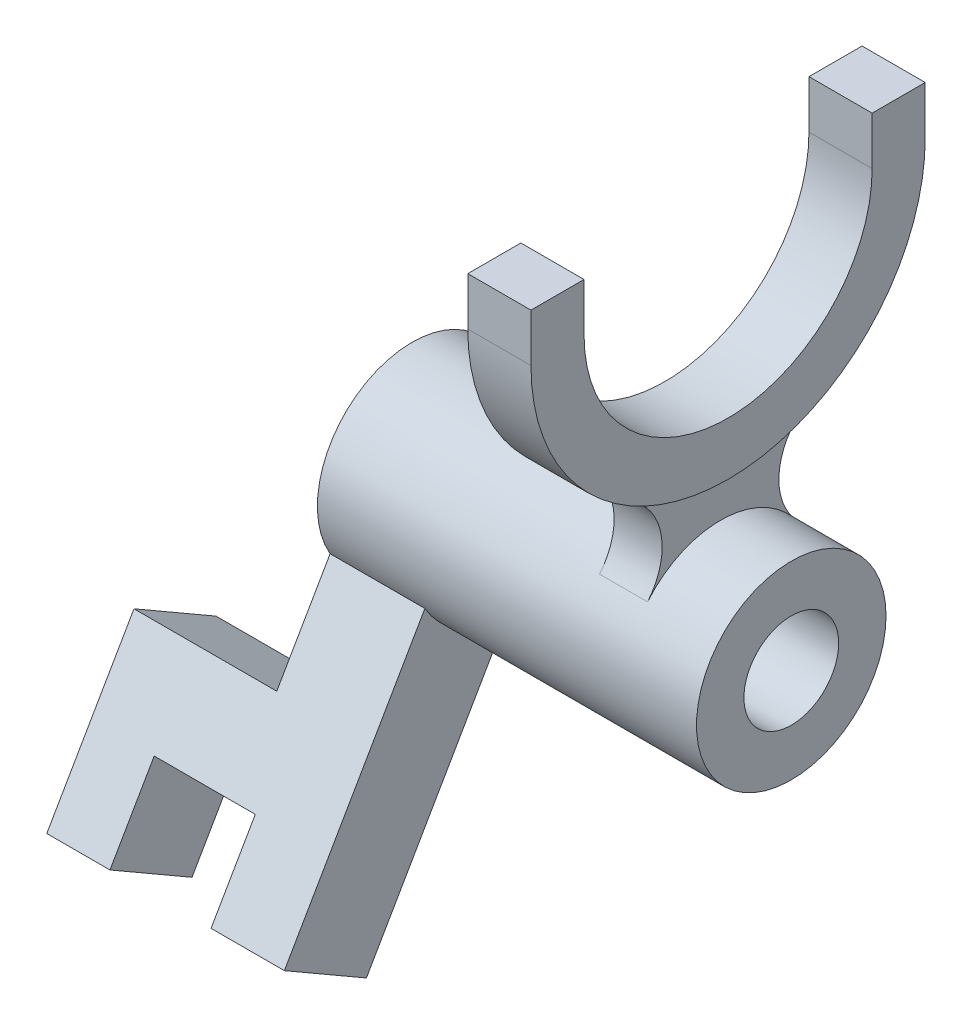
ISO-10303-21;
HEADER;
FILE_DESCRIPTION(('STEP AP214'),'2;1');
FILE_NAME('part.step','',(''),(''),'','','');
FILE_SCHEMA(('AUTOMOTIVE_DESIGN { 1 0 10303 214 1 1 1 1 }'));
ENDSEC;
DATA;
#1=APPLICATION_CONTEXT('core data for automotive mechanical design processes');
#2=APPLICATION_PROTOCOL_DEFINITION('international standard','automotive_design',2000,#1);
#3=PRODUCT_CONTEXT('',#1,'mechanical');
#4=PRODUCT('Part','Part','',(#3));
#5=PRODUCT_RELATED_PRODUCT_CATEGORY('part','',(#4));
#6=PRODUCT_DEFINITION_FORMATION('','',#4);
#7=PRODUCT_DEFINITION_CONTEXT('part definition',#1,'design');
#8=PRODUCT_DEFINITION('design','',#6,#7);
#9=PRODUCT_DEFINITION_SHAPE('','',#8);
#10=(LENGTH_UNIT() NAMED_UNIT(*) SI_UNIT(.MILLI.,.METRE.));
#11=(NAMED_UNIT(*) PLANE_ANGLE_UNIT() SI_UNIT($,.RADIAN.));
#12=(NAMED_UNIT(*) SI_UNIT($,.STERADIAN.) SOLID_ANGLE_UNIT());
#13=UNCERTAINTY_MEASURE_WITH_UNIT(LENGTH_MEASURE(1.E-05),#10,'distance_accuracy_value','');
#14=(GEOMETRIC_REPRESENTATION_CONTEXT(3) GLOBAL_UNCERTAINTY_ASSIGNED_CONTEXT((#13)) GLOBAL_UNIT_ASSIGNED_CONTEXT((#10,
#11,#12)) REPRESENTATION_CONTEXT('',''));
#15=CARTESIAN_POINT('',(0.,0.,0.));
#16=DIRECTION('',(0.,0.,1.));
#17=DIRECTION('',(1.,0.,0.));
#18=AXIS2_PLACEMENT_3D('',#15,#16,#17);
#19=CARTESIAN_POINT('',(-57.15,0.,0.));
#20=DIRECTION('',(1.,0.,0.));
#21=DIRECTION('',(0.,0.,-1.));
#22=AXIS2_PLACEMENT_3D('',#19,#20,#21);
#23=CYLINDRICAL_SURFACE('',#22,19.05);
#24=DIRECTION('',(1.,0.,0.));
#25=VECTOR('',#24,1.);
#26=CARTESIAN_POINT('',(-57.15,-9.52499999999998,16.4977839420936));
#27=LINE('',#26,#25);
#28=CARTESIAN_POINT('',(-38.1,-9.52499999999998,16.4977839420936));
#29=VERTEX_POINT('',#28);
#30=CARTESIAN_POINT('',(-57.15,-9.52499999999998,16.4977839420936));
#31=VERTEX_POINT('',#30);
#32=EDGE_CURVE('E185',#29,#31,#27,.F.);
#33=ORIENTED_EDGE('',*,*,#32,.F.);
#34=CARTESIAN_POINT('',(-38.1,0.,0.));
#35=DIRECTION('',(-1.,0.,0.));
#36=DIRECTION('',(0.,0.,1.));
#37=AXIS2_PLACEMENT_3D('',#34,#35,#36);
#38=CIRCLE('',#37,19.05);
#39=CARTESIAN_POINT('',(-38.1,-19.05,0.));
#40=VERTEX_POINT('',#39);
#41=EDGE_CURVE('E194',#29,#40,#38,.F.);
#42=ORIENTED_EDGE('',*,*,#41,.T.);
#43=DIRECTION('',(1.,0.,0.));
#44=VECTOR('',#43,1.);
#45=CARTESIAN_POINT('',(-57.15,-19.05,0.));
#46=LINE('',#45,#44);
#47=CARTESIAN_POINT('',(-57.15,-19.05,0.));
#48=VERTEX_POINT('',#47);
#49=EDGE_CURVE('E254',#40,#48,#46,.F.);
#50=ORIENTED_EDGE('',*,*,#49,.T.);
#51=CARTESIAN_POINT('',(-57.15,0.,0.));
#52=DIRECTION('',(1.,0.,0.));
#53=DIRECTION('',(0.,0.,-1.));
#54=AXIS2_PLACEMENT_3D('',#51,#52,#53);
#55=CIRCLE('',#54,19.05);
#56=EDGE_CURVE('E11',#48,#31,#55,.T.);
#57=ORIENTED_EDGE('',*,*,#56,.T.);
#58=EDGE_LOOP('',(#33,#42,#50,#57));
#59=FACE_BOUND('',#58,.T.);
#60=CARTESIAN_POINT('',(19.05,0.,0.));
#61=DIRECTION('',(1.,0.,0.));
#62=DIRECTION('',(0.,0.,-1.));
#63=AXIS2_PLACEMENT_3D('',#60,#61,#62);
#64=CIRCLE('',#63,19.05);
#65=CARTESIAN_POINT('',(19.05,0.,-19.05));
#66=VERTEX_POINT('',#65);
#67=EDGE_CURVE('E349',#66,#66,#64,.T.);
#68=ORIENTED_EDGE('',*,*,#67,.F.);
#69=EDGE_LOOP('',(#68));
#70=FACE_BOUND('',#69,.T.);
#71=DIRECTION('',(-1.,0.,0.));
#72=VECTOR('',#71,1.);
#73=CARTESIAN_POINT('',(4.826,12.1666969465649,-14.6585806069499));
#74=LINE('',#73,#72);
#75=CARTESIAN_POINT('',(4.826,12.1666969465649,-14.6585806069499));
#76=VERTEX_POINT('',#75);
#77=CARTESIAN_POINT('',(-4.826,12.1666969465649,-14.6585806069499));
#78=VERTEX_POINT('',#77);
#79=EDGE_CURVE('E341',#76,#78,#74,.T.);
#80=ORIENTED_EDGE('',*,*,#79,.F.);
#81=CARTESIAN_POINT('',(4.826,0.,0.));
#82=DIRECTION('',(-1.,0.,0.));
#83=DIRECTION('',(0.,0.,-1.));
#84=AXIS2_PLACEMENT_3D('',#81,#82,#83);
#85=CIRCLE('',#84,19.05);
#86=CARTESIAN_POINT('',(4.826,12.1666969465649,14.6585806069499));
#87=VERTEX_POINT('',#86);
#88=EDGE_CURVE('E52',#87,#76,#85,.T.);
#89=ORIENTED_EDGE('',*,*,#88,.F.);
#90=DIRECTION('',(-1.,0.,0.));
#91=VECTOR('',#90,1.);
#92=CARTESIAN_POINT('',(4.826,12.1666969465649,14.6585806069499));
#93=LINE('',#92,#91);
#94=CARTESIAN_POINT('',(-4.826,12.1666969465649,14.6585806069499));
#95=VERTEX_POINT('',#94);
#96=EDGE_CURVE('E344',#87,#95,#93,.T.);
#97=ORIENTED_EDGE('',*,*,#96,.T.);
#98=CARTESIAN_POINT('',(-4.826,0.,0.));
#99=DIRECTION('',(-1.,0.,0.));
#100=DIRECTION('',(0.,0.,-1.));
#101=AXIS2_PLACEMENT_3D('',#98,#99,#100);
#102=CIRCLE('',#101,19.05);
#103=EDGE_CURVE('E330',#95,#78,#102,.T.);
#104=ORIENTED_EDGE('',*,*,#103,.T.);
#105=EDGE_LOOP('',(#80,#89,#97,#104));
#106=FACE_BOUND('',#105,.T.);
#107=ADVANCED_FACE('F30',(#59,#70,#106),#23,.T.);
#108=CARTESIAN_POINT('',(-57.15,0.,0.));
#109=DIRECTION('',(1.,0.,0.));
#110=DIRECTION('',(0.,0.,-1.));
#111=AXIS2_PLACEMENT_3D('',#108,#109,#110);
#112=PLANE('',#111);
#113=CARTESIAN_POINT('',(-57.15,0.,0.));
#114=DIRECTION('',(1.,0.,0.));
#115=DIRECTION('',(0.,0.,-1.));
#116=AXIS2_PLACEMENT_3D('',#113,#114,#115);
#117=CIRCLE('',#116,9.525);
#118=CARTESIAN_POINT('',(-57.15,0.,-9.525));
#119=VERTEX_POINT('',#118);
#120=EDGE_CURVE('E37',#119,#119,#117,.T.);
#121=ORIENTED_EDGE('',*,*,#120,.T.);
#122=EDGE_LOOP('',(#121));
#123=FACE_BOUND('',#122,.T.);
#124=ORIENTED_EDGE('',*,*,#56,.F.);
#125=DIRECTION('',(0.,-0.866025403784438,0.500000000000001));
#126=VECTOR('',#125,1.);
#127=CARTESIAN_POINT('',(-57.15,-13.0113919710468,-3.48639197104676));
#128=LINE('',#127,#126);
#129=CARTESIAN_POINT('',(-57.15,-37.6200421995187,10.7214188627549));
#130=VERTEX_POINT('',#129);
#131=EDGE_CURVE('E44',#48,#130,#128,.T.);
#132=ORIENTED_EDGE('',*,*,#131,.T.);
#133=DIRECTION('',(0.,-0.500000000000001,-0.866025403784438));
#134=VECTOR('',#133,1.);
#135=CARTESIAN_POINT('',(-57.15,-28.0950421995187,27.2192028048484));
#136=LINE('',#135,#134);
#137=CARTESIAN_POINT('',(-57.15,-28.0950421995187,27.2192028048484));
#138=VERTEX_POINT('',#137);
#139=EDGE_CURVE('E191',#138,#130,#136,.T.);
#140=ORIENTED_EDGE('',*,*,#139,.F.);
#141=DIRECTION('',(0.,-0.866025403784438,0.500000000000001));
#142=VECTOR('',#141,1.);
#143=CARTESIAN_POINT('',(-57.15,-3.48639197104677,13.0113919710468));
#144=LINE('',#143,#142);
#145=EDGE_CURVE('E177',#31,#138,#144,.T.);
#146=ORIENTED_EDGE('',*,*,#145,.F.);
#147=EDGE_LOOP('',(#124,#132,#140,#146));
#148=FACE_BOUND('',#147,.T.);
#149=ADVANCED_FACE('F192',(#123,#148),#112,.F.);
#150=CARTESIAN_POINT('',(-57.15,0.,0.));
#151=DIRECTION('',(1.,0.,0.));
#152=DIRECTION('',(0.,0.,-1.));
#153=AXIS2_PLACEMENT_3D('',#150,#151,#152);
#154=CYLINDRICAL_SURFACE('',#153,9.525);
#155=ORIENTED_EDGE('',*,*,#120,.F.);
#156=EDGE_LOOP('',(#155));
#157=FACE_BOUND('',#156,.T.);
#158=CARTESIAN_POINT('',(19.05,0.,0.));
#159=DIRECTION('',(1.,0.,0.));
#160=DIRECTION('',(0.,0.,-1.));
#161=AXIS2_PLACEMENT_3D('',#158,#159,#160);
#162=CIRCLE('',#161,9.525);
#163=CARTESIAN_POINT('',(19.05,0.,-9.525));
#164=VERTEX_POINT('',#163);
#165=EDGE_CURVE('E346',#164,#164,#162,.T.);
#166=ORIENTED_EDGE('',*,*,#165,.T.);
#167=EDGE_LOOP('',(#166));
#168=FACE_BOUND('',#167,.T.);
#169=ADVANCED_FACE('F355',(#157,#168),#154,.F.);
#170=CARTESIAN_POINT('',(19.05,0.,0.));
#171=DIRECTION('',(1.,0.,0.));
#172=DIRECTION('',(0.,0.,-1.));
#173=AXIS2_PLACEMENT_3D('',#170,#171,#172);
#174=PLANE('',#173);
#175=ORIENTED_EDGE('',*,*,#67,.T.);
#176=EDGE_LOOP('',(#175));
#177=FACE_BOUND('',#176,.T.);
#178=ORIENTED_EDGE('',*,*,#165,.F.);
#179=EDGE_LOOP('',(#178));
#180=FACE_BOUND('',#179,.T.);
#181=ADVANCED_FACE('F358',(#177,#180),#174,.T.);
#182=CARTESIAN_POINT('',(4.826,20.2778282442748,24.4309676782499));
#183=DIRECTION('',(-1.,0.,0.));
#184=DIRECTION('',(0.,0.,1.));
#185=AXIS2_PLACEMENT_3D('',#182,#183,#184);
#186=CYLINDRICAL_SURFACE('',#185,12.7);
#187=CARTESIAN_POINT('',(-4.826,20.2778282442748,24.4309676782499));
#188=DIRECTION('',(-1.,0.,0.));
#189=DIRECTION('',(0.,0.,1.));
#190=AXIS2_PLACEMENT_3D('',#187,#188,#189);
#191=CIRCLE('',#190,12.7);
#192=CARTESIAN_POINT('',(-4.826,31.5084524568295,18.5011211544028));
#193=VERTEX_POINT('',#192);
#194=EDGE_CURVE('E318',#193,#95,#191,.T.);
#195=ORIENTED_EDGE('',*,*,#194,.T.);
#196=ORIENTED_EDGE('',*,*,#96,.F.);
#197=CARTESIAN_POINT('',(4.826,20.2778282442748,24.4309676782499));
#198=DIRECTION('',(-1.,0.,0.));
#199=DIRECTION('',(0.,0.,1.));
#200=AXIS2_PLACEMENT_3D('',#197,#198,#199);
#201=CIRCLE('',#200,12.7);
#202=CARTESIAN_POINT('',(4.826,31.5084524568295,18.5011211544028));
#203=VERTEX_POINT('',#202);
#204=EDGE_CURVE('E319',#203,#87,#201,.T.);
#205=ORIENTED_EDGE('',*,*,#204,.F.);
#206=DIRECTION('',(-1.,0.,0.));
#207=VECTOR('',#206,1.);
#208=CARTESIAN_POINT('',(4.826,31.5084524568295,18.5011211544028));
#209=LINE('',#208,#207);
#210=EDGE_CURVE('E327',#203,#193,#209,.T.);
#211=ORIENTED_EDGE('',*,*,#210,.T.);
#212=EDGE_LOOP('',(#195,#196,#205,#211));
#213=FACE_BOUND('',#212,.T.);
#214=ADVANCED_FACE('F363',(#213),#186,.F.);
#215=CARTESIAN_POINT('',(4.826,20.2778282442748,-24.4309676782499));
#216=DIRECTION('',(-1.,0.,0.));
#217=DIRECTION('',(0.,0.,1.));
#218=AXIS2_PLACEMENT_3D('',#215,#216,#217);
#219=CYLINDRICAL_SURFACE('',#218,12.7);
#220=CARTESIAN_POINT('',(-4.826,20.2778282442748,-24.4309676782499));
#221=DIRECTION('',(-1.,0.,0.));
#222=DIRECTION('',(0.,0.,-1.));
#223=AXIS2_PLACEMENT_3D('',#220,#221,#222);
#224=CIRCLE('',#223,12.7);
#225=CARTESIAN_POINT('',(-4.826,31.5084524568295,-18.5011211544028));
#226=VERTEX_POINT('',#225);
#227=EDGE_CURVE('E332',#78,#226,#224,.T.);
#228=ORIENTED_EDGE('',*,*,#227,.T.);
#229=DIRECTION('',(-1.,0.,0.));
#230=VECTOR('',#229,1.);
#231=CARTESIAN_POINT('',(4.826,31.5084524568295,-18.5011211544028));
#232=LINE('',#231,#230);
#233=CARTESIAN_POINT('',(4.826,31.5084524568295,-18.5011211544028));
#234=VERTEX_POINT('',#233);
#235=EDGE_CURVE('E338',#234,#226,#232,.T.);
#236=ORIENTED_EDGE('',*,*,#235,.F.);
#237=CARTESIAN_POINT('',(4.826,20.2778282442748,-24.4309676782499));
#238=DIRECTION('',(-1.,0.,0.));
#239=DIRECTION('',(0.,0.,-1.));
#240=AXIS2_PLACEMENT_3D('',#237,#238,#239);
#241=CIRCLE('',#240,12.7);
#242=EDGE_CURVE('E323',#76,#234,#241,.T.);
#243=ORIENTED_EDGE('',*,*,#242,.F.);
#244=ORIENTED_EDGE('',*,*,#79,.T.);
#245=EDGE_LOOP('',(#228,#236,#243,#244));
#246=FACE_BOUND('',#245,.T.);
#247=ADVANCED_FACE('F369',(#246),#219,.F.);
#248=CARTESIAN_POINT('',(4.826,10.1389141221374,12.2154838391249));
#249=DIRECTION('',(-1.,0.,0.));
#250=DIRECTION('',(0.,0.,1.));
#251=AXIS2_PLACEMENT_3D('',#248,#249,#250);
#252=PLANE('',#251);
#253=ORIENTED_EDGE('',*,*,#204,.T.);
#254=ORIENTED_EDGE('',*,*,#88,.T.);
#255=ORIENTED_EDGE('',*,*,#242,.T.);
#256=CARTESIAN_POINT('',(4.826,66.548,0.));
#257=DIRECTION('',(-1.,0.,0.));
#258=DIRECTION('',(0.,0.,-1.));
#259=AXIS2_PLACEMENT_3D('',#256,#257,#258);
#260=CIRCLE('',#259,39.624);
#261=EDGE_CURVE('E325',#234,#203,#260,.T.);
#262=ORIENTED_EDGE('',*,*,#261,.T.);
#263=EDGE_LOOP('',(#253,#254,#255,#262));
#264=FACE_BOUND('',#263,.T.);
#265=ADVANCED_FACE('F384',(#264),#252,.F.);
#266=CARTESIAN_POINT('',(-4.826,10.1389141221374,12.2154838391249));
#267=DIRECTION('',(-1.,0.,0.));
#268=DIRECTION('',(0.,0.,1.));
#269=AXIS2_PLACEMENT_3D('',#266,#267,#268);
#270=PLANE('',#269);
#271=ORIENTED_EDGE('',*,*,#194,.F.);
#272=CARTESIAN_POINT('',(-4.826,66.548,0.));
#273=DIRECTION('',(-1.,0.,0.));
#274=DIRECTION('',(0.,0.,-1.));
#275=AXIS2_PLACEMENT_3D('',#272,#273,#274);
#276=CIRCLE('',#275,39.624);
#277=EDGE_CURVE('E321',#226,#193,#276,.T.);
#278=ORIENTED_EDGE('',*,*,#277,.F.);
#279=ORIENTED_EDGE('',*,*,#227,.F.);
#280=ORIENTED_EDGE('',*,*,#103,.F.);
#281=EDGE_LOOP('',(#271,#278,#279,#280));
#282=FACE_BOUND('',#281,.T.);
#283=ADVANCED_FACE('F394',(#282),#270,.T.);
#284=CARTESIAN_POINT('',(6.35,66.548,0.));
#285=DIRECTION('',(-1.,0.,0.));
#286=DIRECTION('',(0.,0.,1.));
#287=AXIS2_PLACEMENT_3D('',#284,#285,#286);
#288=CYLINDRICAL_SURFACE('',#287,39.624);
#289=CARTESIAN_POINT('',(-6.35,66.548,0.));
#290=DIRECTION('',(1.,0.,0.));
#291=DIRECTION('',(0.,0.,-1.));
#292=AXIS2_PLACEMENT_3D('',#289,#290,#291);
#293=CIRCLE('',#292,39.624);
#294=CARTESIAN_POINT('',(-6.35,66.548,39.624));
#295=VERTEX_POINT('',#294);
#296=CARTESIAN_POINT('',(-6.35,66.548,-39.624));
#297=VERTEX_POINT('',#296);
#298=EDGE_CURVE('E261',#295,#297,#293,.T.);
#299=ORIENTED_EDGE('',*,*,#298,.T.);
#300=DIRECTION('',(-1.,0.,0.));
#301=VECTOR('',#300,1.);
#302=CARTESIAN_POINT('',(6.35,66.548,-39.624));
#303=LINE('',#302,#301);
#304=CARTESIAN_POINT('',(6.35,66.548,-39.624));
#305=VERTEX_POINT('',#304);
#306=EDGE_CURVE('E280',#305,#297,#303,.T.);
#307=ORIENTED_EDGE('',*,*,#306,.F.);
#308=CARTESIAN_POINT('',(6.35,66.548,0.));
#309=DIRECTION('',(1.,0.,0.));
#310=DIRECTION('',(0.,0.,-1.));
#311=AXIS2_PLACEMENT_3D('',#308,#309,#310);
#312=CIRCLE('',#311,39.624);
#313=CARTESIAN_POINT('',(6.35,66.548,39.624));
#314=VERTEX_POINT('',#313);
#315=EDGE_CURVE('E278',#314,#305,#312,.T.);
#316=ORIENTED_EDGE('',*,*,#315,.F.);
#317=DIRECTION('',(-1.,0.,0.));
#318=VECTOR('',#317,1.);
#319=CARTESIAN_POINT('',(6.35,66.548,39.624));
#320=LINE('',#319,#318);
#321=EDGE_CURVE('E303',#314,#295,#320,.T.);
#322=ORIENTED_EDGE('',*,*,#321,.T.);
#323=EDGE_LOOP('',(#299,#307,#316,#322));
#324=FACE_BOUND('',#323,.T.);
#325=ORIENTED_EDGE('',*,*,#210,.F.);
#326=ORIENTED_EDGE('',*,*,#261,.F.);
#327=ORIENTED_EDGE('',*,*,#235,.T.);
#328=ORIENTED_EDGE('',*,*,#277,.T.);
#329=EDGE_LOOP('',(#325,#326,#327,#328));
#330=FACE_BOUND('',#329,.T.);
#331=ADVANCED_FACE('F392',(#324,#330),#288,.T.);
#332=CARTESIAN_POINT('',(6.35,66.548,-39.624));
#333=DIRECTION('',(0.,0.,1.));
#334=DIRECTION('',(1.,0.,0.));
#335=AXIS2_PLACEMENT_3D('',#332,#333,#334);
#336=PLANE('',#335);
#337=DIRECTION('',(0.,1.,0.));
#338=VECTOR('',#337,1.);
#339=CARTESIAN_POINT('',(-6.35,66.548,-39.624));
#340=LINE('',#339,#338);
#341=CARTESIAN_POINT('',(-6.35,76.2,-39.624));
#342=VERTEX_POINT('',#341);
#343=EDGE_CURVE('E257',#297,#342,#340,.T.);
#344=ORIENTED_EDGE('',*,*,#343,.T.);
#345=DIRECTION('',(-1.,0.,0.));
#346=VECTOR('',#345,1.);
#347=CARTESIAN_POINT('',(6.35,76.2,-39.624));
#348=LINE('',#347,#346);
#349=CARTESIAN_POINT('',(6.35,76.2,-39.624));
#350=VERTEX_POINT('',#349);
#351=EDGE_CURVE('E316',#350,#342,#348,.T.);
#352=ORIENTED_EDGE('',*,*,#351,.F.);
#353=DIRECTION('',(0.,1.,0.));
#354=VECTOR('',#353,1.);
#355=CARTESIAN_POINT('',(6.35,66.548,-39.624));
#356=LINE('',#355,#354);
#357=EDGE_CURVE('E258',#305,#350,#356,.T.);
#358=ORIENTED_EDGE('',*,*,#357,.F.);
#359=ORIENTED_EDGE('',*,*,#306,.T.);
#360=EDGE_LOOP('',(#344,#352,#358,#359));
#361=FACE_BOUND('',#360,.T.);
#362=ADVANCED_FACE('F401',(#361),#336,.F.);
#363=CARTESIAN_POINT('',(6.35,76.2,-28.956));
#364=DIRECTION('',(0.,1.,0.));
#365=DIRECTION('',(0.,0.,1.));
#366=AXIS2_PLACEMENT_3D('',#363,#364,#365);
#367=PLANE('',#366);
#368=DIRECTION('',(0.,0.,-1.));
#369=VECTOR('',#368,1.);
#370=CARTESIAN_POINT('',(-6.35,76.2,-28.956));
#371=LINE('',#370,#369);
#372=CARTESIAN_POINT('',(-6.35,76.2,-28.956));
#373=VERTEX_POINT('',#372);
#374=EDGE_CURVE('E283',#373,#342,#371,.T.);
#375=ORIENTED_EDGE('',*,*,#374,.F.);
#376=DIRECTION('',(-1.,0.,0.));
#377=VECTOR('',#376,1.);
#378=CARTESIAN_POINT('',(6.35,76.2,-28.956));
#379=LINE('',#378,#377);
#380=CARTESIAN_POINT('',(6.35,76.2,-28.956));
#381=VERTEX_POINT('',#380);
#382=EDGE_CURVE('E314',#381,#373,#379,.T.);
#383=ORIENTED_EDGE('',*,*,#382,.F.);
#384=DIRECTION('',(0.,0.,-1.));
#385=VECTOR('',#384,1.);
#386=CARTESIAN_POINT('',(6.35,76.2,-28.956));
#387=LINE('',#386,#385);
#388=EDGE_CURVE('E260',#381,#350,#387,.T.);
#389=ORIENTED_EDGE('',*,*,#388,.T.);
#390=ORIENTED_EDGE('',*,*,#351,.T.);
#391=EDGE_LOOP('',(#375,#383,#389,#390));
#392=FACE_BOUND('',#391,.T.);
#393=ADVANCED_FACE('F437',(#392),#367,.T.);
#394=CARTESIAN_POINT('',(6.35,66.548,-28.956));
#395=DIRECTION('',(0.,0.,1.));
#396=DIRECTION('',(1.,0.,0.));
#397=AXIS2_PLACEMENT_3D('',#394,#395,#396);
#398=PLANE('',#397);
#399=DIRECTION('',(0.,1.,0.));
#400=VECTOR('',#399,1.);
#401=CARTESIAN_POINT('',(-6.35,66.548,-28.956));
#402=LINE('',#401,#400);
#403=CARTESIAN_POINT('',(-6.35,66.548,-28.956));
#404=VERTEX_POINT('',#403);
#405=EDGE_CURVE('E286',#404,#373,#402,.T.);
#406=ORIENTED_EDGE('',*,*,#405,.F.);
#407=DIRECTION('',(-1.,0.,0.));
#408=VECTOR('',#407,1.);
#409=CARTESIAN_POINT('',(6.35,66.548,-28.956));
#410=LINE('',#409,#408);
#411=CARTESIAN_POINT('',(6.35,66.548,-28.956));
#412=VERTEX_POINT('',#411);
#413=EDGE_CURVE('E312',#412,#404,#410,.T.);
#414=ORIENTED_EDGE('',*,*,#413,.F.);
#415=DIRECTION('',(0.,1.,0.));
#416=VECTOR('',#415,1.);
#417=CARTESIAN_POINT('',(6.35,66.548,-28.956));
#418=LINE('',#417,#416);
#419=EDGE_CURVE('E264',#412,#381,#418,.T.);
#420=ORIENTED_EDGE('',*,*,#419,.T.);
#421=ORIENTED_EDGE('',*,*,#382,.T.);
#422=EDGE_LOOP('',(#406,#414,#420,#421));
#423=FACE_BOUND('',#422,.T.);
#424=ADVANCED_FACE('F446',(#423),#398,.T.);
#425=CARTESIAN_POINT('',(6.35,66.548,0.));
#426=DIRECTION('',(-1.,0.,0.));
#427=DIRECTION('',(0.,0.,1.));
#428=AXIS2_PLACEMENT_3D('',#425,#426,#427);
#429=CYLINDRICAL_SURFACE('',#428,28.956);
#430=CARTESIAN_POINT('',(-6.35,66.548,0.));
#431=DIRECTION('',(1.,0.,0.));
#432=DIRECTION('',(0.,0.,-1.));
#433=AXIS2_PLACEMENT_3D('',#430,#431,#432);
#434=CIRCLE('',#433,28.956);
#435=CARTESIAN_POINT('',(-6.35,66.548,28.956));
#436=VERTEX_POINT('',#435);
#437=EDGE_CURVE('E289',#436,#404,#434,.T.);
#438=ORIENTED_EDGE('',*,*,#437,.F.);
#439=DIRECTION('',(-1.,0.,0.));
#440=VECTOR('',#439,1.);
#441=CARTESIAN_POINT('',(6.35,66.548,28.956));
#442=LINE('',#441,#440);
#443=CARTESIAN_POINT('',(6.35,66.548,28.956));
#444=VERTEX_POINT('',#443);
#445=EDGE_CURVE('E310',#444,#436,#442,.T.);
#446=ORIENTED_EDGE('',*,*,#445,.F.);
#447=CARTESIAN_POINT('',(6.35,66.548,0.));
#448=DIRECTION('',(1.,0.,0.));
#449=DIRECTION('',(0.,0.,-1.));
#450=AXIS2_PLACEMENT_3D('',#447,#448,#449);
#451=CIRCLE('',#450,28.956);
#452=EDGE_CURVE('E267',#444,#412,#451,.T.);
#453=ORIENTED_EDGE('',*,*,#452,.T.);
#454=ORIENTED_EDGE('',*,*,#413,.T.);
#455=EDGE_LOOP('',(#438,#446,#453,#454));
#456=FACE_BOUND('',#455,.T.);
#457=ADVANCED_FACE('F456',(#456),#429,.F.);
#458=CARTESIAN_POINT('',(6.35,66.548,28.956));
#459=DIRECTION('',(0.,0.,-1.));
#460=DIRECTION('',(-1.,0.,0.));
#461=AXIS2_PLACEMENT_3D('',#458,#459,#460);
#462=PLANE('',#461);
#463=DIRECTION('',(0.,1.,0.));
#464=VECTOR('',#463,1.);
#465=CARTESIAN_POINT('',(-6.35,66.548,28.956));
#466=LINE('',#465,#464);
#467=CARTESIAN_POINT('',(-6.35,76.2,28.956));
#468=VERTEX_POINT('',#467);
#469=EDGE_CURVE('E292',#468,#436,#466,.F.);
#470=ORIENTED_EDGE('',*,*,#469,.F.);
#471=DIRECTION('',(-1.,0.,0.));
#472=VECTOR('',#471,1.);
#473=CARTESIAN_POINT('',(6.35,76.2,28.956));
#474=LINE('',#473,#472);
#475=CARTESIAN_POINT('',(6.35,76.2,28.956));
#476=VERTEX_POINT('',#475);
#477=EDGE_CURVE('E308',#476,#468,#474,.T.);
#478=ORIENTED_EDGE('',*,*,#477,.F.);
#479=DIRECTION('',(0.,1.,0.));
#480=VECTOR('',#479,1.);
#481=CARTESIAN_POINT('',(6.35,66.548,28.956));
#482=LINE('',#481,#480);
#483=EDGE_CURVE('E270',#476,#444,#482,.F.);
#484=ORIENTED_EDGE('',*,*,#483,.T.);
#485=ORIENTED_EDGE('',*,*,#445,.T.);
#486=EDGE_LOOP('',(#470,#478,#484,#485));
#487=FACE_BOUND('',#486,.T.);
#488=ADVANCED_FACE('F466',(#487),#462,.T.);
#489=CARTESIAN_POINT('',(6.35,76.2,39.624));
#490=DIRECTION('',(0.,1.,0.));
#491=DIRECTION('',(0.,0.,1.));
#492=AXIS2_PLACEMENT_3D('',#489,#490,#491);
#493=PLANE('',#492);
#494=DIRECTION('',(0.,0.,-1.));
#495=VECTOR('',#494,1.);
#496=CARTESIAN_POINT('',(-6.35,76.2,39.624));
#497=LINE('',#496,#495);
#498=CARTESIAN_POINT('',(-6.35,76.2,39.624));
#499=VERTEX_POINT('',#498);
#500=EDGE_CURVE('E295',#499,#468,#497,.T.);
#501=ORIENTED_EDGE('',*,*,#500,.F.);
#502=DIRECTION('',(-1.,0.,0.));
#503=VECTOR('',#502,1.);
#504=CARTESIAN_POINT('',(6.35,76.2,39.624));
#505=LINE('',#504,#503);
#506=CARTESIAN_POINT('',(6.35,76.2,39.624));
#507=VERTEX_POINT('',#506);
#508=EDGE_CURVE('E306',#507,#499,#505,.T.);
#509=ORIENTED_EDGE('',*,*,#508,.F.);
#510=DIRECTION('',(0.,0.,-1.));
#511=VECTOR('',#510,1.);
#512=CARTESIAN_POINT('',(6.35,76.2,39.624));
#513=LINE('',#512,#511);
#514=EDGE_CURVE('E273',#507,#476,#513,.T.);
#515=ORIENTED_EDGE('',*,*,#514,.T.);
#516=ORIENTED_EDGE('',*,*,#477,.T.);
#517=EDGE_LOOP('',(#501,#509,#515,#516));
#518=FACE_BOUND('',#517,.T.);
#519=ADVANCED_FACE('F476',(#518),#493,.T.);
#520=CARTESIAN_POINT('',(6.35,66.548,39.624));
#521=DIRECTION('',(0.,0.,-1.));
#522=DIRECTION('',(-1.,0.,0.));
#523=AXIS2_PLACEMENT_3D('',#520,#521,#522);
#524=PLANE('',#523);
#525=DIRECTION('',(0.,-1.,0.));
#526=VECTOR('',#525,1.);
#527=CARTESIAN_POINT('',(-6.35,66.548,39.624));
#528=LINE('',#527,#526);
#529=EDGE_CURVE('E298',#499,#295,#528,.T.);
#530=ORIENTED_EDGE('',*,*,#529,.T.);
#531=ORIENTED_EDGE('',*,*,#321,.F.);
#532=DIRECTION('',(0.,-1.,0.));
#533=VECTOR('',#532,1.);
#534=CARTESIAN_POINT('',(6.35,66.548,39.624));
#535=LINE('',#534,#533);
#536=EDGE_CURVE('E276',#507,#314,#535,.T.);
#537=ORIENTED_EDGE('',*,*,#536,.F.);
#538=ORIENTED_EDGE('',*,*,#508,.T.);
#539=EDGE_LOOP('',(#530,#531,#537,#538));
#540=FACE_BOUND('',#539,.T.);
#541=ADVANCED_FACE('F486',(#540),#524,.F.);
#542=CARTESIAN_POINT('',(6.35,66.548,0.));
#543=DIRECTION('',(1.,0.,0.));
#544=DIRECTION('',(0.,0.,-1.));
#545=AXIS2_PLACEMENT_3D('',#542,#543,#544);
#546=PLANE('',#545);
#547=ORIENTED_EDGE('',*,*,#357,.T.);
#548=ORIENTED_EDGE('',*,*,#388,.F.);
#549=ORIENTED_EDGE('',*,*,#419,.F.);
#550=ORIENTED_EDGE('',*,*,#452,.F.);
#551=ORIENTED_EDGE('',*,*,#483,.F.);
#552=ORIENTED_EDGE('',*,*,#514,.F.);
#553=ORIENTED_EDGE('',*,*,#536,.T.);
#554=ORIENTED_EDGE('',*,*,#315,.T.);
#555=EDGE_LOOP('',(#547,#548,#549,#550,#551,#552,#553,#554));
#556=FACE_BOUND('',#555,.T.);
#557=ADVANCED_FACE('F496',(#556),#546,.T.);
#558=CARTESIAN_POINT('',(-6.35,66.548,0.));
#559=DIRECTION('',(1.,0.,0.));
#560=DIRECTION('',(0.,0.,-1.));
#561=AXIS2_PLACEMENT_3D('',#558,#559,#560);
#562=PLANE('',#561);
#563=ORIENTED_EDGE('',*,*,#343,.F.);
#564=ORIENTED_EDGE('',*,*,#298,.F.);
#565=ORIENTED_EDGE('',*,*,#529,.F.);
#566=ORIENTED_EDGE('',*,*,#500,.T.);
#567=ORIENTED_EDGE('',*,*,#469,.T.);
#568=ORIENTED_EDGE('',*,*,#437,.T.);
#569=ORIENTED_EDGE('',*,*,#405,.T.);
#570=ORIENTED_EDGE('',*,*,#374,.T.);
#571=EDGE_LOOP('',(#563,#564,#565,#566,#567,#568,#569,#570));
#572=FACE_BOUND('',#571,.T.);
#573=ADVANCED_FACE('F506',(#572),#562,.F.);
#574=CARTESIAN_POINT('',(-57.15,-28.0950421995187,27.2192028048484));
#575=DIRECTION('',(0.,-0.866025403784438,0.500000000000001));
#576=DIRECTION('',(0.,-0.500000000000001,-0.866025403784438));
#577=AXIS2_PLACEMENT_3D('',#574,#575,#576);
#578=PLANE('',#577);
#579=DIRECTION('',(-1.,0.,0.));
#580=VECTOR('',#579,1.);
#581=CARTESIAN_POINT('',(-57.15,-37.6200421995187,10.7214188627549));
#582=LINE('',#581,#580);
#583=CARTESIAN_POINT('',(-85.852,-37.6200421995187,10.7214188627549));
#584=VERTEX_POINT('',#583);
#585=EDGE_CURVE('E218',#130,#584,#582,.T.);
#586=ORIENTED_EDGE('',*,*,#585,.T.);
#587=DIRECTION('',(0.,-0.500000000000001,-0.866025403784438));
#588=VECTOR('',#587,1.);
#589=CARTESIAN_POINT('',(-85.852,-28.0950421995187,27.2192028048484));
#590=LINE('',#589,#588);
#591=CARTESIAN_POINT('',(-85.852,-28.0950421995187,27.2192028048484));
#592=VERTEX_POINT('',#591);
#593=EDGE_CURVE('E195',#592,#584,#590,.T.);
#594=ORIENTED_EDGE('',*,*,#593,.F.);
#595=DIRECTION('',(-1.,0.,0.));
#596=VECTOR('',#595,1.);
#597=CARTESIAN_POINT('',(-57.15,-28.0950421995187,27.2192028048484));
#598=LINE('',#597,#596);
#599=EDGE_CURVE('E182',#138,#592,#598,.T.);
#600=ORIENTED_EDGE('',*,*,#599,.F.);
#601=ORIENTED_EDGE('',*,*,#139,.T.);
#602=EDGE_LOOP('',(#586,#594,#600,#601));
#603=FACE_BOUND('',#602,.T.);
#604=ADVANCED_FACE('F197',(#603),#578,.F.);
#605=CARTESIAN_POINT('',(-85.852,-28.0950421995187,27.2192028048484));
#606=DIRECTION('',(1.,0.,0.));
#607=DIRECTION('',(0.,0.,-1.));
#608=AXIS2_PLACEMENT_3D('',#605,#606,#607);
#609=PLANE('',#608);
#610=DIRECTION('',(0.,-0.866025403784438,0.500000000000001));
#611=VECTOR('',#610,1.);
#612=CARTESIAN_POINT('',(-85.852,-37.6200421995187,10.7214188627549));
#613=LINE('',#612,#611);
#614=CARTESIAN_POINT('',(-85.852,-67.9759646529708,28.2474188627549));
#615=VERTEX_POINT('',#614);
#616=EDGE_CURVE('E220',#584,#615,#613,.T.);
#617=ORIENTED_EDGE('',*,*,#616,.T.);
#618=DIRECTION('',(0.,-0.500000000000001,-0.866025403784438));
#619=VECTOR('',#618,1.);
#620=CARTESIAN_POINT('',(-85.852,-58.4509646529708,44.7452028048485));
#621=LINE('',#620,#619);
#622=CARTESIAN_POINT('',(-85.852,-58.4509646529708,44.7452028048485));
#623=VERTEX_POINT('',#622);
#624=EDGE_CURVE('E248',#623,#615,#621,.T.);
#625=ORIENTED_EDGE('',*,*,#624,.F.);
#626=DIRECTION('',(0.,-0.866025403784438,0.500000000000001));
#627=VECTOR('',#626,1.);
#628=CARTESIAN_POINT('',(-85.852,-28.0950421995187,27.2192028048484));
#629=LINE('',#628,#627);
#630=EDGE_CURVE('E200',#592,#623,#629,.T.);
#631=ORIENTED_EDGE('',*,*,#630,.F.);
#632=ORIENTED_EDGE('',*,*,#593,.T.);
#633=EDGE_LOOP('',(#617,#625,#631,#632));
#634=FACE_BOUND('',#633,.T.);
#635=ADVANCED_FACE('F542',(#634),#609,.F.);
#636=CARTESIAN_POINT('',(-85.852,-58.4509646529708,44.7452028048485));
#637=DIRECTION('',(0.,0.866025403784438,-0.500000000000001));
#638=DIRECTION('',(0.,0.500000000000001,0.866025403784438));
#639=AXIS2_PLACEMENT_3D('',#636,#637,#638);
#640=PLANE('',#639);
#641=DIRECTION('',(1.,0.,0.));
#642=VECTOR('',#641,1.);
#643=CARTESIAN_POINT('',(-85.852,-67.9759646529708,28.2474188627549));
#644=LINE('',#643,#642);
#645=CARTESIAN_POINT('',(-73.152,-67.9759646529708,28.2474188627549));
#646=VERTEX_POINT('',#645);
#647=EDGE_CURVE('E222',#615,#646,#644,.T.);
#648=ORIENTED_EDGE('',*,*,#647,.T.);
#649=DIRECTION('',(0.,-0.500000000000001,-0.866025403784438));
#650=VECTOR('',#649,1.);
#651=CARTESIAN_POINT('',(-73.152,-58.4509646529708,44.7452028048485));
#652=LINE('',#651,#650);
#653=CARTESIAN_POINT('',(-73.152,-58.4509646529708,44.7452028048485));
#654=VERTEX_POINT('',#653);
#655=EDGE_CURVE('E245',#654,#646,#652,.T.);
#656=ORIENTED_EDGE('',*,*,#655,.F.);
#657=DIRECTION('',(1.,0.,0.));
#658=VECTOR('',#657,1.);
#659=CARTESIAN_POINT('',(-85.852,-58.4509646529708,44.7452028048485));
#660=LINE('',#659,#658);
#661=EDGE_CURVE('E202',#623,#654,#660,.T.);
#662=ORIENTED_EDGE('',*,*,#661,.F.);
#663=ORIENTED_EDGE('',*,*,#624,.T.);
#664=EDGE_LOOP('',(#648,#656,#662,#663));
#665=FACE_BOUND('',#664,.T.);
#666=ADVANCED_FACE('F551',(#665),#640,.F.);
#667=CARTESIAN_POINT('',(-73.152,-58.4509646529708,44.7452028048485));
#668=DIRECTION('',(-1.,0.,0.));
#669=DIRECTION('',(0.,0.,1.));
#670=AXIS2_PLACEMENT_3D('',#667,#668,#669);
#671=PLANE('',#670);
#672=DIRECTION('',(0.,0.866025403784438,-0.500000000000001));
#673=VECTOR('',#672,1.);
#674=CARTESIAN_POINT('',(-73.152,-67.9759646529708,28.2474188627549));
#675=LINE('',#674,#673);
#676=CARTESIAN_POINT('',(-73.152,-52.5780329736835,19.3574188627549));
#677=VERTEX_POINT('',#676);
#678=EDGE_CURVE('E224',#646,#677,#675,.T.);
#679=ORIENTED_EDGE('',*,*,#678,.T.);
#680=DIRECTION('',(0.,-0.500000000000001,-0.866025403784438));
#681=VECTOR('',#680,1.);
#682=CARTESIAN_POINT('',(-73.152,-43.0530329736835,35.8552028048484));
#683=LINE('',#682,#681);
#684=CARTESIAN_POINT('',(-73.152,-43.0530329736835,35.8552028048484));
#685=VERTEX_POINT('',#684);
#686=EDGE_CURVE('E242',#685,#677,#683,.T.);
#687=ORIENTED_EDGE('',*,*,#686,.F.);
#688=DIRECTION('',(0.,0.866025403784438,-0.500000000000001));
#689=VECTOR('',#688,1.);
#690=CARTESIAN_POINT('',(-73.152,-58.4509646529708,44.7452028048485));
#691=LINE('',#690,#689);
#692=EDGE_CURVE('E206',#654,#685,#691,.T.);
#693=ORIENTED_EDGE('',*,*,#692,.F.);
#694=ORIENTED_EDGE('',*,*,#655,.T.);
#695=EDGE_LOOP('',(#679,#687,#693,#694));
#696=FACE_BOUND('',#695,.T.);
#697=ADVANCED_FACE('F561',(#696),#671,.F.);
#698=CARTESIAN_POINT('',(-73.152,-43.0530329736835,35.8552028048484));
#699=DIRECTION('',(0.,0.866025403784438,-0.500000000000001));
#700=DIRECTION('',(0.,0.500000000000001,0.866025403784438));
#701=AXIS2_PLACEMENT_3D('',#698,#699,#700);
#702=PLANE('',#701);
#703=DIRECTION('',(1.,0.,0.));
#704=VECTOR('',#703,1.);
#705=CARTESIAN_POINT('',(-73.152,-52.5780329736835,19.3574188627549));
#706=LINE('',#705,#704);
#707=CARTESIAN_POINT('',(-52.832,-52.5780329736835,19.3574188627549));
#708=VERTEX_POINT('',#707);
#709=EDGE_CURVE('E226',#677,#708,#706,.T.);
#710=ORIENTED_EDGE('',*,*,#709,.T.);
#711=DIRECTION('',(0.,-0.500000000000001,-0.866025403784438));
#712=VECTOR('',#711,1.);
#713=CARTESIAN_POINT('',(-52.832,-43.0530329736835,35.8552028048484));
#714=LINE('',#713,#712);
#715=CARTESIAN_POINT('',(-52.832,-43.0530329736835,35.8552028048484));
#716=VERTEX_POINT('',#715);
#717=EDGE_CURVE('E239',#716,#708,#714,.T.);
#718=ORIENTED_EDGE('',*,*,#717,.F.);
#719=DIRECTION('',(1.,0.,0.));
#720=VECTOR('',#719,1.);
#721=CARTESIAN_POINT('',(-73.152,-43.0530329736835,35.8552028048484));
#722=LINE('',#721,#720);
#723=EDGE_CURVE('E208',#685,#716,#722,.T.);
#724=ORIENTED_EDGE('',*,*,#723,.F.);
#725=ORIENTED_EDGE('',*,*,#686,.T.);
#726=EDGE_LOOP('',(#710,#718,#724,#725));
#727=FACE_BOUND('',#726,.T.);
#728=ADVANCED_FACE('F571',(#727),#702,.F.);
#729=CARTESIAN_POINT('',(-52.832,-43.0530329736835,35.8552028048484));
#730=DIRECTION('',(1.,0.,0.));
#731=DIRECTION('',(0.,0.,-1.));
#732=AXIS2_PLACEMENT_3D('',#729,#730,#731);
#733=PLANE('',#732);
#734=DIRECTION('',(0.,-0.866025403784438,0.500000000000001));
#735=VECTOR('',#734,1.);
#736=CARTESIAN_POINT('',(-52.832,-52.5780329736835,19.3574188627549));
#737=LINE('',#736,#735);
#738=CARTESIAN_POINT('',(-52.832,-67.9759646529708,28.2474188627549));
#739=VERTEX_POINT('',#738);
#740=EDGE_CURVE('E228',#708,#739,#737,.T.);
#741=ORIENTED_EDGE('',*,*,#740,.T.);
#742=DIRECTION('',(0.,-0.500000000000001,-0.866025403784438));
#743=VECTOR('',#742,1.);
#744=CARTESIAN_POINT('',(-52.832,-58.4509646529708,44.7452028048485));
#745=LINE('',#744,#743);
#746=CARTESIAN_POINT('',(-52.832,-58.4509646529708,44.7452028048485));
#747=VERTEX_POINT('',#746);
#748=EDGE_CURVE('E236',#747,#739,#745,.T.);
#749=ORIENTED_EDGE('',*,*,#748,.F.);
#750=DIRECTION('',(0.,-0.866025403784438,0.500000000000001));
#751=VECTOR('',#750,1.);
#752=CARTESIAN_POINT('',(-52.832,-43.0530329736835,35.8552028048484));
#753=LINE('',#752,#751);
#754=EDGE_CURVE('E210',#716,#747,#753,.T.);
#755=ORIENTED_EDGE('',*,*,#754,.F.);
#756=ORIENTED_EDGE('',*,*,#717,.T.);
#757=EDGE_LOOP('',(#741,#749,#755,#756));
#758=FACE_BOUND('',#757,.T.);
#759=ADVANCED_FACE('F581',(#758),#733,.F.);
#760=CARTESIAN_POINT('',(-52.832,-58.4509646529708,44.7452028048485));
#761=DIRECTION('',(0.,0.866025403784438,-0.500000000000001));
#762=DIRECTION('',(0.,0.500000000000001,0.866025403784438));
#763=AXIS2_PLACEMENT_3D('',#760,#761,#762);
#764=PLANE('',#763);
#765=DIRECTION('',(1.,0.,0.));
#766=VECTOR('',#765,1.);
#767=CARTESIAN_POINT('',(-52.832,-67.9759646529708,28.2474188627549));
#768=LINE('',#767,#766);
#769=CARTESIAN_POINT('',(-38.1,-67.9759646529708,28.2474188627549));
#770=VERTEX_POINT('',#769);
#771=EDGE_CURVE('E230',#739,#770,#768,.T.);
#772=ORIENTED_EDGE('',*,*,#771,.T.);
#773=DIRECTION('',(0.,-0.500000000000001,-0.866025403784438));
#774=VECTOR('',#773,1.);
#775=CARTESIAN_POINT('',(-38.1,-58.4509646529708,44.7452028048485));
#776=LINE('',#775,#774);
#777=CARTESIAN_POINT('',(-38.1,-58.4509646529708,44.7452028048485));
#778=VERTEX_POINT('',#777);
#779=EDGE_CURVE('E216',#778,#770,#776,.T.);
#780=ORIENTED_EDGE('',*,*,#779,.F.);
#781=DIRECTION('',(1.,0.,0.));
#782=VECTOR('',#781,1.);
#783=CARTESIAN_POINT('',(-52.832,-58.4509646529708,44.7452028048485));
#784=LINE('',#783,#782);
#785=EDGE_CURVE('E212',#747,#778,#784,.T.);
#786=ORIENTED_EDGE('',*,*,#785,.F.);
#787=ORIENTED_EDGE('',*,*,#748,.T.);
#788=EDGE_LOOP('',(#772,#780,#786,#787));
#789=FACE_BOUND('',#788,.T.);
#790=ADVANCED_FACE('F591',(#789),#764,.F.);
#791=CARTESIAN_POINT('',(-38.1,-58.4509646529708,44.7452028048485));
#792=DIRECTION('',(-1.,0.,0.));
#793=DIRECTION('',(0.,0.,1.));
#794=AXIS2_PLACEMENT_3D('',#791,#792,#793);
#795=PLANE('',#794);
#796=ORIENTED_EDGE('',*,*,#41,.F.);
#797=DIRECTION('',(0.,0.866025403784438,-0.500000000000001));
#798=VECTOR('',#797,1.);
#799=CARTESIAN_POINT('',(-38.1,-58.4509646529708,44.7452028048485));
#800=LINE('',#799,#798);
#801=EDGE_CURVE('E214',#778,#29,#800,.T.);
#802=ORIENTED_EDGE('',*,*,#801,.F.);
#803=ORIENTED_EDGE('',*,*,#779,.T.);
#804=DIRECTION('',(0.,0.866025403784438,-0.500000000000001));
#805=VECTOR('',#804,1.);
#806=CARTESIAN_POINT('',(-38.1,-67.9759646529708,28.2474188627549));
#807=LINE('',#806,#805);
#808=EDGE_CURVE('E188',#770,#40,#807,.T.);
#809=ORIENTED_EDGE('',*,*,#808,.T.);
#810=EDGE_LOOP('',(#796,#802,#803,#809));
#811=FACE_BOUND('',#810,.T.);
#812=ADVANCED_FACE('F601',(#811),#795,.F.);
#813=CARTESIAN_POINT('',(-57.15,-3.48639197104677,13.0113919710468));
#814=DIRECTION('',(0.,0.500000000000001,0.866025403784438));
#815=DIRECTION('',(0.,-0.866025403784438,0.500000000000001));
#816=AXIS2_PLACEMENT_3D('',#813,#814,#815);
#817=PLANE('',#816);
#818=ORIENTED_EDGE('',*,*,#801,.T.);
#819=ORIENTED_EDGE('',*,*,#32,.T.);
#820=ORIENTED_EDGE('',*,*,#145,.T.);
#821=ORIENTED_EDGE('',*,*,#599,.T.);
#822=ORIENTED_EDGE('',*,*,#630,.T.);
#823=ORIENTED_EDGE('',*,*,#661,.T.);
#824=ORIENTED_EDGE('',*,*,#692,.T.);
#825=ORIENTED_EDGE('',*,*,#723,.T.);
#826=ORIENTED_EDGE('',*,*,#754,.T.);
#827=ORIENTED_EDGE('',*,*,#785,.T.);
#828=EDGE_LOOP('',(#818,#819,#820,#821,#822,#823,#824,#825,#826,#827));
#829=FACE_BOUND('',#828,.T.);
#830=ADVANCED_FACE('F180',(#829),#817,.T.);
#831=CARTESIAN_POINT('',(-57.15,-13.0113919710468,-3.48639197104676));
#832=DIRECTION('',(0.,0.500000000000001,0.866025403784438));
#833=DIRECTION('',(0.,-0.866025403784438,0.500000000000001));
#834=AXIS2_PLACEMENT_3D('',#831,#832,#833);
#835=PLANE('',#834);
#836=ORIENTED_EDGE('',*,*,#49,.F.);
#837=ORIENTED_EDGE('',*,*,#808,.F.);
#838=ORIENTED_EDGE('',*,*,#771,.F.);
#839=ORIENTED_EDGE('',*,*,#740,.F.);
#840=ORIENTED_EDGE('',*,*,#709,.F.);
#841=ORIENTED_EDGE('',*,*,#678,.F.);
#842=ORIENTED_EDGE('',*,*,#647,.F.);
#843=ORIENTED_EDGE('',*,*,#616,.F.);
#844=ORIENTED_EDGE('',*,*,#585,.F.);
#845=ORIENTED_EDGE('',*,*,#131,.F.);
#846=EDGE_LOOP('',(#836,#837,#838,#839,#840,#841,#842,#843,#844,#845));
#847=FACE_BOUND('',#846,.T.);
#848=ADVANCED_FACE('F620',(#847),#835,.F.);
#849=CLOSED_SHELL('',(#107,#149,#169,#181,#214,#247,#265,#283,#331,#362,#393,#424,#457,#488,
#519,#541,#557,#573,#604,#635,#666,#697,#728,#759,#790,#812,#830,#848));
#850=MANIFOLD_SOLID_BREP('B2',#849);
#851=ADVANCED_BREP_SHAPE_REPRESENTATION('',(#18,#850),#14);
#852=SHAPE_DEFINITION_REPRESENTATION(#9,#851);
ENDSEC;
END-ISO-10303-21;
